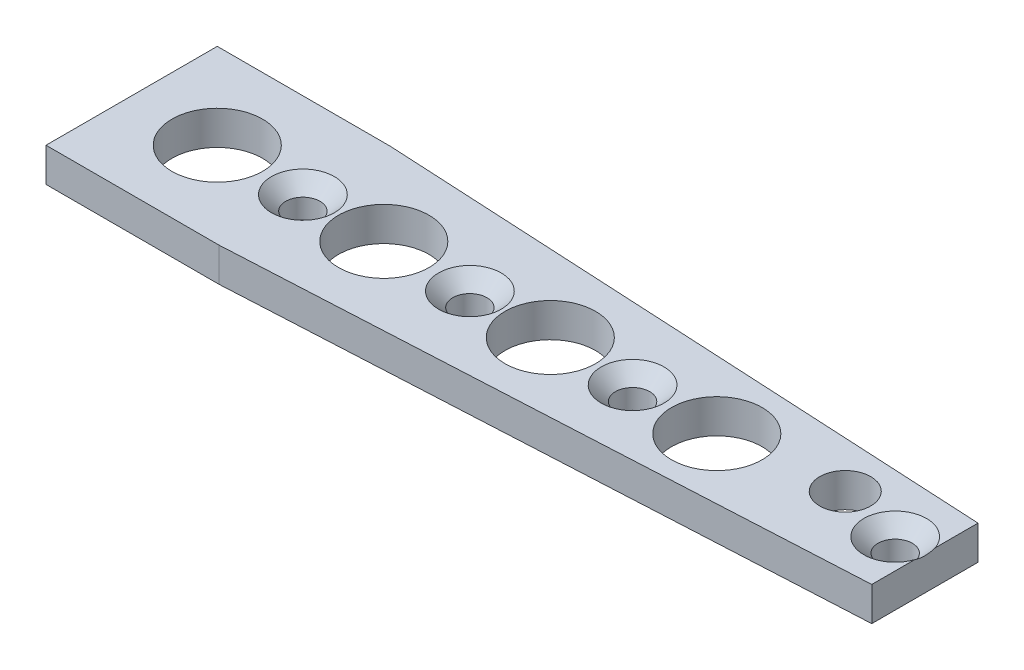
from build123d import *

# Parameters (mm, degrees)
BOSS_EXTRUDE1_DEPTH                             = 2.38
F_1_4_0_25_DIAMETER_HOLE1_D                     = 6.35
LPATTERN1_COUNT                                 = 4
LPATTERN1_PITCH                                 = 11.667
F_9_64_0_14063_DIAMETER_HOLE1_D                 = 3.572002
CSK_FOR_M2_FLAT_HEAD_MACHINE_SCREW1_D           = 2.4
CSK_FOR_M2_FLAT_HEAD_MACHINE_SCREW1_CSINK_D     = 4.4
CSK_FOR_M2_FLAT_HEAD_MACHINE_SCREW1_CSINK_ANGLE = 90
SKETCH13_OUTSIDE_W                              = 69.018
SKETCH13_OUTSIDE_H                              = 26.708
CUT_EXTRUDE1_DEPTH                              = 57.025208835


with BuildPart() as part:
    # Sketch1 → Boss-Extrude1 (new body)
    with BuildSketch(Plane(origin=(0, 0, 0), x_dir=(1, 0, 0), z_dir=(0, 1, 0))):
        Polygon((55.58, 3.722175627), (0, 6.635), (0, -6.635), (55.58, -3.722175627), align=None)
    extrude(amount=BOSS_EXTRUDE1_DEPTH)

    # 1_4 _0.25_ Diameter Hole1 (through all)
    with Locations(Plane(origin=(0, 2.38, 0), x_dir=(1, 0, 0), z_dir=(0, 1, 0))):
        with Locations((6, 0)):
            f_1_4_0_25_diameter_hole1 = Hole(F_1_4_0_25_DIAMETER_HOLE1_D / 2)

    # LPattern1: 1_4 _0.25_ Diameter Hole1 ×4
    with Locations(*[(i * LPATTERN1_PITCH, 0, 0) for i in range(1, LPATTERN1_COUNT)]):
        add(f_1_4_0_25_diameter_hole1, mode=Mode.SUBTRACT)

    # 9_64 _0.14063_ Diameter Hole1 (through all)
    with Locations(Plane(origin=(0, 2.38, 0), x_dir=(1, 0, 0), z_dir=(0, 1, 0))):
        with Locations((49, 1)):
            Hole(F_9_64_0_14063_DIAMETER_HOLE1_D / 2)

    # CSK for M2 Flat Head Machine Screw1 (through all)
    with Locations(Plane(origin=(0, 2.38, 0), x_dir=(1, 0, 0), z_dir=(0, 1, 0))):
        with Locations((12, 0), (23.7, 0), (35.1, 0), (53.5, 0)):
            CounterSinkHole(CSK_FOR_M2_FLAT_HEAD_MACHINE_SCREW1_D / 2, CSK_FOR_M2_FLAT_HEAD_MACHINE_SCREW1_CSINK_D / 2, counter_sink_angle=CSK_FOR_M2_FLAT_HEAD_MACHINE_SCREW1_CSINK_ANGLE)

    # Sketch13 outside → Cut-Extrude1 (cut, through all)
    with BuildSketch(Plane(origin=(0, 2.38, 0), x_dir=(1, 0, 0), z_dir=(0, 1, 0))):
        with Locations((27.79, 0)):
            Rectangle(SKETCH13_OUTSIDE_W, SKETCH13_OUTSIDE_H)
        Polygon((0, 6), (12.116521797, 6), (55.58, 3.722175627), (55.58, -3.722175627), (12.116521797, -6), (0, -6), align=None, mode=Mode.SUBTRACT)
    extrude(amount=-CUT_EXTRUDE1_DEPTH, mode=Mode.SUBTRACT)


solid = part.part
